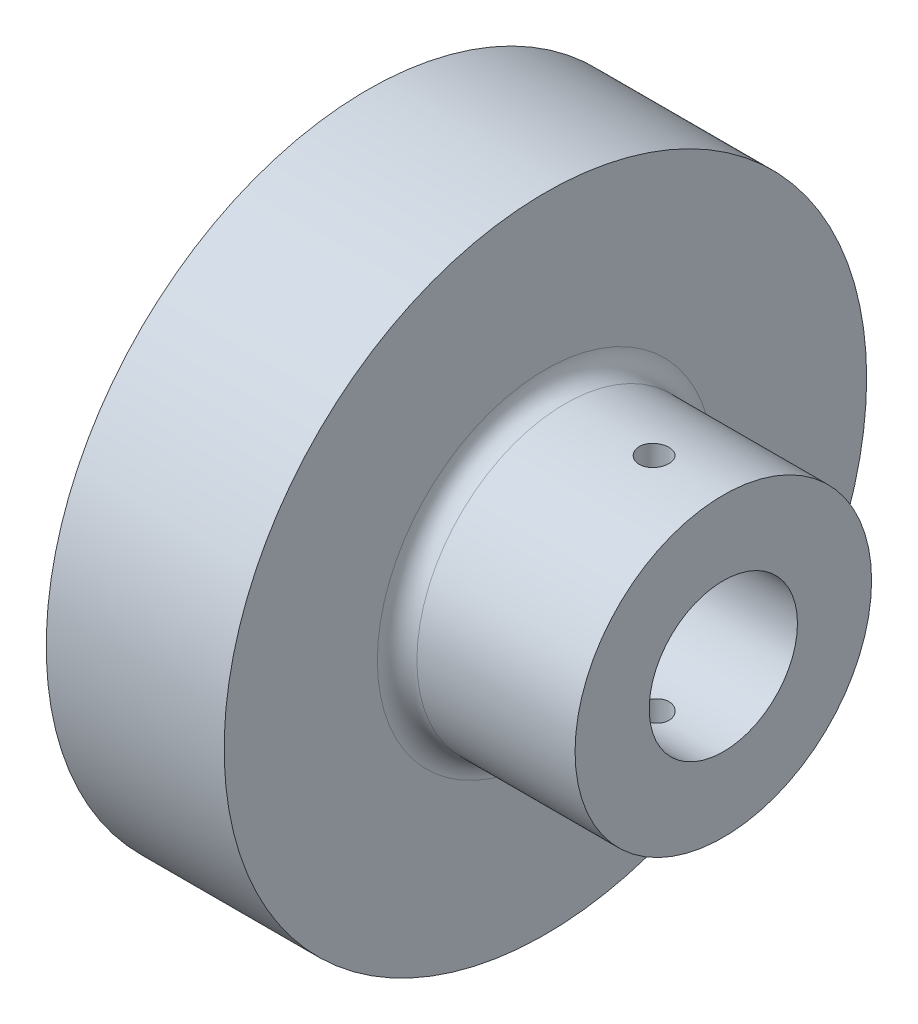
ISO-10303-21;
HEADER;
FILE_DESCRIPTION(('STEP AP214'),'2;1');
FILE_NAME('part.step','',(''),(''),'','','');
FILE_SCHEMA(('AUTOMOTIVE_DESIGN { 1 0 10303 214 1 1 1 1 }'));
ENDSEC;
DATA;
#1=APPLICATION_CONTEXT('core data for automotive mechanical design processes');
#2=APPLICATION_PROTOCOL_DEFINITION('international standard','automotive_design',2000,#1);
#3=PRODUCT_CONTEXT('',#1,'mechanical');
#4=PRODUCT('Part','Part','',(#3));
#5=PRODUCT_RELATED_PRODUCT_CATEGORY('part','',(#4));
#6=PRODUCT_DEFINITION_FORMATION('','',#4);
#7=PRODUCT_DEFINITION_CONTEXT('part definition',#1,'design');
#8=PRODUCT_DEFINITION('design','',#6,#7);
#9=PRODUCT_DEFINITION_SHAPE('','',#8);
#10=(LENGTH_UNIT() NAMED_UNIT(*) SI_UNIT(.MILLI.,.METRE.));
#11=(NAMED_UNIT(*) PLANE_ANGLE_UNIT() SI_UNIT($,.RADIAN.));
#12=(NAMED_UNIT(*) SI_UNIT($,.STERADIAN.) SOLID_ANGLE_UNIT());
#13=UNCERTAINTY_MEASURE_WITH_UNIT(LENGTH_MEASURE(1.E-05),#10,'distance_accuracy_value','');
#14=(GEOMETRIC_REPRESENTATION_CONTEXT(3) GLOBAL_UNCERTAINTY_ASSIGNED_CONTEXT((#13)) GLOBAL_UNIT_ASSIGNED_CONTEXT((#10,
#11,#12)) REPRESENTATION_CONTEXT('',''));
#15=CARTESIAN_POINT('',(0.,0.,0.));
#16=DIRECTION('',(0.,0.,1.));
#17=DIRECTION('',(1.,0.,0.));
#18=AXIS2_PLACEMENT_3D('',#15,#16,#17);
#19=CARTESIAN_POINT('',(74.9237880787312,0.,0.));
#20=DIRECTION('',(1.,0.,0.));
#21=DIRECTION('',(0.,0.,-1.));
#22=AXIS2_PLACEMENT_3D('',#19,#20,#21);
#23=CYLINDRICAL_SURFACE('',#22,7.49999999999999);
#24=CARTESIAN_POINT('',(31.3659501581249,-7.34846922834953,-1.5));
#25=CARTESIAN_POINT('',(31.4492967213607,-7.34847088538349,-1.49999691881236));
#26=CARTESIAN_POINT('',(31.5326820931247,-7.34990262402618,-1.49302975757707));
#27=CARTESIAN_POINT('',(31.6970939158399,-7.35546646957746,-1.46536842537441));
#28=CARTESIAN_POINT('',(31.778118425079,-7.35960073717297,-1.44466327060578));
#29=CARTESIAN_POINT('',(31.9354061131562,-7.37008310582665,-1.39019367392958));
#30=CARTESIAN_POINT('',(32.0116739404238,-7.37642900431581,-1.35644222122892));
#31=CARTESIAN_POINT('',(32.1574624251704,-7.39061699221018,-1.27687366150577));
#32=CARTESIAN_POINT('',(32.2269834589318,-7.39845899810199,-1.23105722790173));
#33=CARTESIAN_POINT('',(32.3582916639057,-7.4148794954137,-1.12796861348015));
#34=CARTESIAN_POINT('',(32.4199695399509,-7.42346606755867,-1.07055848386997));
#35=CARTESIAN_POINT('',(32.5328864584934,-7.44033708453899,-0.946210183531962));
#36=CARTESIAN_POINT('',(32.5841247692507,-7.44862150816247,-0.879271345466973));
#37=CARTESIAN_POINT('',(32.6751321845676,-7.46404194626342,-0.73704203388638));
#38=CARTESIAN_POINT('',(32.7147974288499,-7.47116732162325,-0.661683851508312));
#39=CARTESIAN_POINT('',(32.7808625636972,-7.48337605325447,-0.505206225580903));
#40=CARTESIAN_POINT('',(32.8072636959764,-7.48845960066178,-0.424087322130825));
#41=CARTESIAN_POINT('',(32.8457109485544,-7.49595481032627,-0.259525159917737));
#42=CARTESIAN_POINT('',(32.8579416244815,-7.4984007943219,-0.176126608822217));
#43=CARTESIAN_POINT('',(32.8682765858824,-7.50046381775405,-0.00842785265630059));
#44=CARTESIAN_POINT('',(32.8663822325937,-7.50008112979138,0.0758722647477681));
#45=CARTESIAN_POINT('',(32.8486608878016,-7.49655652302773,0.241713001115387));
#46=CARTESIAN_POINT('',(32.8330326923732,-7.49345397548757,0.323275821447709));
#47=CARTESIAN_POINT('',(32.7886026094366,-7.48488265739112,0.482597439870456));
#48=CARTESIAN_POINT('',(32.7598001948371,-7.47941379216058,0.560356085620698));
#49=CARTESIAN_POINT('',(32.689655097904,-7.46665944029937,0.710429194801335));
#50=CARTESIAN_POINT('',(32.6482345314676,-7.45936272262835,0.782706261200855));
#51=CARTESIAN_POINT('',(32.55408654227,-7.44375704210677,0.91935756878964));
#52=CARTESIAN_POINT('',(32.5013578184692,-7.43544796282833,0.983730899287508));
#53=CARTESIAN_POINT('',(32.3849997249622,-7.41856446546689,1.10392714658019));
#54=CARTESIAN_POINT('',(32.3211963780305,-7.40998794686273,1.15958147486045));
#55=CARTESIAN_POINT('',(32.1850754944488,-7.3936735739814,1.25942773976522));
#56=CARTESIAN_POINT('',(32.1127577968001,-7.38593573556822,1.30361945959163));
#57=CARTESIAN_POINT('',(31.9614189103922,-7.37217071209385,1.37934422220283));
#58=CARTESIAN_POINT('',(31.8823837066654,-7.36614722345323,1.41084997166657));
#59=CARTESIAN_POINT('',(31.7199931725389,-7.35654714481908,1.46008551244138));
#60=CARTESIAN_POINT('',(31.6366384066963,-7.35297023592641,1.47781709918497));
#61=CARTESIAN_POINT('',(31.4695028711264,-7.34873218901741,1.49874900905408));
#62=CARTESIAN_POINT('',(31.3857537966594,-7.34802220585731,1.50219278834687));
#63=CARTESIAN_POINT('',(31.2188778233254,-7.3494672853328,1.49510644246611));
#64=CARTESIAN_POINT('',(31.1357508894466,-7.35162218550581,1.48457710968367));
#65=CARTESIAN_POINT('',(30.9732971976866,-7.35850848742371,1.45005331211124));
#66=CARTESIAN_POINT('',(30.8939416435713,-7.36321498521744,1.42618893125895));
#67=CARTESIAN_POINT('',(30.7403552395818,-7.37465234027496,1.36581155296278));
#68=CARTESIAN_POINT('',(30.6661248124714,-7.38138336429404,1.32929751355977));
#69=CARTESIAN_POINT('',(30.5238304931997,-7.39622108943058,1.2441062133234));
#70=CARTESIAN_POINT('',(30.4558595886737,-7.40434457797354,1.19527661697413));
#71=CARTESIAN_POINT('',(30.3289876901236,-7.42100585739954,1.08704335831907));
#72=CARTESIAN_POINT('',(30.270087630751,-7.42954369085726,1.0276386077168));
#73=CARTESIAN_POINT('',(30.1621063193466,-7.44623018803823,0.898848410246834));
#74=CARTESIAN_POINT('',(30.1131896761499,-7.45437086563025,0.829323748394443));
#75=CARTESIAN_POINT('',(30.0277313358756,-7.46920691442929,0.68290184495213));
#76=CARTESIAN_POINT('',(29.9911891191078,-7.47590234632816,0.606004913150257));
#77=CARTESIAN_POINT('',(29.931756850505,-7.487059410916,0.447454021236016));
#78=CARTESIAN_POINT('',(29.9087893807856,-7.49153368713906,0.365830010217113));
#79=CARTESIAN_POINT('',(29.8769132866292,-7.4977985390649,0.199784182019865));
#80=CARTESIAN_POINT('',(29.8680029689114,-7.49958943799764,0.115362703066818));
#81=CARTESIAN_POINT('',(29.8645596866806,-7.5002781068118,-0.0523093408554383));
#82=CARTESIAN_POINT('',(29.8697792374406,-7.49922567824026,-0.135554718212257));
#83=CARTESIAN_POINT('',(29.8939010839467,-7.49445065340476,-0.299956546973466));
#84=CARTESIAN_POINT('',(29.912803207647,-7.49072809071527,-0.381113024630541));
#85=CARTESIAN_POINT('',(29.9636436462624,-7.48103247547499,-0.538879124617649));
#86=CARTESIAN_POINT('',(29.9955522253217,-7.47506455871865,-0.615498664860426));
#87=CARTESIAN_POINT('',(30.0714685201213,-7.46152083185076,-0.762331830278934));
#88=CARTESIAN_POINT('',(30.1154771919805,-7.45394489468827,-0.832544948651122));
#89=CARTESIAN_POINT('',(30.2151792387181,-7.4378639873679,-0.96579583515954));
#90=CARTESIAN_POINT('',(30.2710496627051,-7.42934600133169,-1.02869957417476));
#91=CARTESIAN_POINT('',(30.3925255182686,-7.41241834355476,-1.14432392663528));
#92=CARTESIAN_POINT('',(30.458133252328,-7.40400869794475,-1.19704212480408));
#93=CARTESIAN_POINT('',(30.5980691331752,-7.3881501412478,-1.29133832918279));
#94=CARTESIAN_POINT('',(30.6724835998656,-7.3807125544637,-1.33279022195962));
#95=CARTESIAN_POINT('',(30.8273493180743,-7.36777855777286,-1.40253607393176));
#96=CARTESIAN_POINT('',(30.9077950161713,-7.36228038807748,-1.43084196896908));
#97=CARTESIAN_POINT('',(31.0513438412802,-7.35494521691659,-1.46800370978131));
#98=CARTESIAN_POINT('',(31.1136282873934,-7.35253177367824,-1.47998084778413));
#99=CARTESIAN_POINT('',(31.2392510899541,-7.3492931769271,-1.49598002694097));
#100=CARTESIAN_POINT('',(31.3025894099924,-7.34846796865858,-1.50000234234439));
#101=CARTESIAN_POINT('',(31.3659501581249,-7.34846922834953,-1.5));
#102=B_SPLINE_CURVE_WITH_KNOTS('',3,(#24,#25,#26,#27,#28,#29,#30,#31,#32,#33,#34,#35,#36,#37,
#38,#39,#40,#41,#42,#43,#44,#45,#46,#47,#48,#49,#50,#51,#52,#53,#54,#55,#56,#57,#58,#59,#60,#61,
#62,#63,#64,#65,#66,#67,#68,#69,#70,#71,#72,#73,#74,#75,#76,#77,#78,#79,#80,#81,#82,#83,#84,#85,
#86,#87,#88,#89,#90,#91,#92,#93,#94,#95,#96,#97,#98,#99,#100,#101),.UNSPECIFIED.,.T.,.F.,(4,2,2,
2,2,2,2,2,2,2,2,2,2,2,2,2,2,2,2,2,2,2,2,2,2,2,2,2,2,2,2,2,2,2,2,2,2,2,4),(0.,0.249807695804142,
0.499815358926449,0.749574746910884,0.999320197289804,1.25223378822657,1.50516510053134,
1.76030100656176,2.01541302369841,2.26716373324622,2.51889018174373,2.76703184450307,
3.01518343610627,3.26489886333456,3.514643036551,3.76874020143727,4.02284217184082,
4.27748794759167,4.53210052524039,4.78235636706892,5.03259801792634,5.2804401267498,
5.52830265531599,5.77939589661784,6.03051499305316,6.28548902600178,6.54045234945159,
6.79394720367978,7.04741152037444,7.29646526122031,7.54551587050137,7.7940002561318,
8.04250428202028,8.29501728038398,8.54759008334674,8.80288347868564,9.05794462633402,
9.24785705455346,9.43776293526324),.UNSPECIFIED.);
#103=CARTESIAN_POINT('',(31.3659501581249,-7.34846922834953,-1.5));
#104=VERTEX_POINT('',#103);
#105=EDGE_CURVE('E75',#104,#104,#102,.T.);
#106=ORIENTED_EDGE('',*,*,#105,.T.);
#107=EDGE_LOOP('',(#106));
#108=FACE_BOUND('',#107,.T.);
#109=CARTESIAN_POINT('',(38.3659501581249,0.,0.));
#110=DIRECTION('',(1.,0.,0.));
#111=DIRECTION('',(0.,0.,-1.));
#112=AXIS2_PLACEMENT_3D('',#109,#110,#111);
#113=CIRCLE('',#112,7.5);
#114=CARTESIAN_POINT('',(38.3659501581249,0.,-7.5));
#115=VERTEX_POINT('',#114);
#116=EDGE_CURVE('E65',#115,#115,#113,.T.);
#117=ORIENTED_EDGE('',*,*,#116,.T.);
#118=EDGE_LOOP('',(#117));
#119=FACE_BOUND('',#118,.T.);
#120=CARTESIAN_POINT('',(10.3659501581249,0.,0.));
#121=DIRECTION('',(1.,0.,0.));
#122=DIRECTION('',(0.,0.,-1.));
#123=AXIS2_PLACEMENT_3D('',#120,#121,#122);
#124=CIRCLE('',#123,7.49999999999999);
#125=CARTESIAN_POINT('',(10.3659501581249,0.,-7.49999999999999));
#126=VERTEX_POINT('',#125);
#127=EDGE_CURVE('E157',#126,#126,#124,.T.);
#128=ORIENTED_EDGE('',*,*,#127,.F.);
#129=EDGE_LOOP('',(#128));
#130=FACE_BOUND('',#129,.T.);
#131=CARTESIAN_POINT('',(31.3659501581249,7.34846922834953,-1.5));
#132=CARTESIAN_POINT('',(31.2826035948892,7.34847088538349,-1.49999691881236));
#133=CARTESIAN_POINT('',(31.1992182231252,7.34990262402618,-1.49302975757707));
#134=CARTESIAN_POINT('',(31.03480640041,7.35546646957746,-1.46536842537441));
#135=CARTESIAN_POINT('',(30.9537818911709,7.35960073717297,-1.44466327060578));
#136=CARTESIAN_POINT('',(30.7964942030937,7.37008310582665,-1.39019367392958));
#137=CARTESIAN_POINT('',(30.7202263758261,7.37642900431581,-1.35644222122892));
#138=CARTESIAN_POINT('',(30.5744378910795,7.39061699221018,-1.27687366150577));
#139=CARTESIAN_POINT('',(30.5049168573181,7.39845899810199,-1.23105722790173));
#140=CARTESIAN_POINT('',(30.3736086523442,7.4148794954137,-1.12796861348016));
#141=CARTESIAN_POINT('',(30.311930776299,7.42346606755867,-1.07055848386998));
#142=CARTESIAN_POINT('',(30.1990138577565,7.44033708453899,-0.946210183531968));
#143=CARTESIAN_POINT('',(30.1477755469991,7.44862150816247,-0.879271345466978));
#144=CARTESIAN_POINT('',(30.0567681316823,7.46404194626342,-0.737042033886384));
#145=CARTESIAN_POINT('',(30.0171028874,7.47116732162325,-0.661683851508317));
#146=CARTESIAN_POINT('',(29.9510377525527,7.48337605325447,-0.505206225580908));
#147=CARTESIAN_POINT('',(29.9246366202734,7.48845960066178,-0.42408732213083));
#148=CARTESIAN_POINT('',(29.8861893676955,7.49595481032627,-0.259525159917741));
#149=CARTESIAN_POINT('',(29.8739586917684,7.4984007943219,-0.176126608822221));
#150=CARTESIAN_POINT('',(29.8636237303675,7.50046381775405,-0.00842785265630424));
#151=CARTESIAN_POINT('',(29.8655180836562,7.50008112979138,0.0758722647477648));
#152=CARTESIAN_POINT('',(29.8832394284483,7.49655652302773,0.241713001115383));
#153=CARTESIAN_POINT('',(29.8988676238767,7.49345397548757,0.323275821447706));
#154=CARTESIAN_POINT('',(29.9432977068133,7.48488265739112,0.482597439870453));
#155=CARTESIAN_POINT('',(29.9721001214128,7.47941379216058,0.560356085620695));
#156=CARTESIAN_POINT('',(30.0422452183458,7.46665944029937,0.710429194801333));
#157=CARTESIAN_POINT('',(30.0836657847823,7.45936272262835,0.782706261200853));
#158=CARTESIAN_POINT('',(30.1778137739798,7.44375704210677,0.919357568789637));
#159=CARTESIAN_POINT('',(30.2305424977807,7.43544796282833,0.983730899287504));
#160=CARTESIAN_POINT('',(30.3469005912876,7.41856446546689,1.10392714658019));
#161=CARTESIAN_POINT('',(30.4107039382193,7.40998794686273,1.15958147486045));
#162=CARTESIAN_POINT('',(30.5468248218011,7.3936735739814,1.25942773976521));
#163=CARTESIAN_POINT('',(30.6191425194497,7.38593573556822,1.30361945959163));
#164=CARTESIAN_POINT('',(30.7704814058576,7.37217071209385,1.37934422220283));
#165=CARTESIAN_POINT('',(30.8495166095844,7.36614722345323,1.41084997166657));
#166=CARTESIAN_POINT('',(31.0119071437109,7.35654714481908,1.46008551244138));
#167=CARTESIAN_POINT('',(31.0952619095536,7.35297023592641,1.47781709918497));
#168=CARTESIAN_POINT('',(31.2623974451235,7.34873218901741,1.49874900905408));
#169=CARTESIAN_POINT('',(31.3461465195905,7.34802220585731,1.50219278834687));
#170=CARTESIAN_POINT('',(31.5130224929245,7.3494672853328,1.49510644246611));
#171=CARTESIAN_POINT('',(31.5961494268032,7.35162218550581,1.48457710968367));
#172=CARTESIAN_POINT('',(31.7586031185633,7.35850848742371,1.45005331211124));
#173=CARTESIAN_POINT('',(31.8379586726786,7.36321498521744,1.42618893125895));
#174=CARTESIAN_POINT('',(31.9915450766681,7.37465234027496,1.36581155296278));
#175=CARTESIAN_POINT('',(32.0657755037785,7.38138336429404,1.32929751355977));
#176=CARTESIAN_POINT('',(32.2080698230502,7.39622108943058,1.2441062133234));
#177=CARTESIAN_POINT('',(32.2760407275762,7.40434457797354,1.19527661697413));
#178=CARTESIAN_POINT('',(32.4029126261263,7.42100585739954,1.08704335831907));
#179=CARTESIAN_POINT('',(32.4618126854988,7.42954369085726,1.02763860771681));
#180=CARTESIAN_POINT('',(32.5697939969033,7.44623018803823,0.898848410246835));
#181=CARTESIAN_POINT('',(32.6187106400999,7.45437086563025,0.829323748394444));
#182=CARTESIAN_POINT('',(32.7041689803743,7.46920691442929,0.682901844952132));
#183=CARTESIAN_POINT('',(32.7407111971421,7.47590234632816,0.60600491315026));
#184=CARTESIAN_POINT('',(32.8001434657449,7.487059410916,0.447454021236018));
#185=CARTESIAN_POINT('',(32.8231109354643,7.49153368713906,0.365830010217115));
#186=CARTESIAN_POINT('',(32.8549870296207,7.4977985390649,0.199784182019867));
#187=CARTESIAN_POINT('',(32.8638973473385,7.49958943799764,0.115362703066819));
#188=CARTESIAN_POINT('',(32.8673406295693,7.5002781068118,-0.052309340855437));
#189=CARTESIAN_POINT('',(32.8621210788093,7.49922567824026,-0.135554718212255));
#190=CARTESIAN_POINT('',(32.8379992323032,7.49445065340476,-0.299956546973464));
#191=CARTESIAN_POINT('',(32.8190971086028,7.49072809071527,-0.381113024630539));
#192=CARTESIAN_POINT('',(32.7682566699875,7.48103247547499,-0.538879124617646));
#193=CARTESIAN_POINT('',(32.7363480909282,7.47506455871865,-0.615498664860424));
#194=CARTESIAN_POINT('',(32.6604317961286,7.46152083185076,-0.762331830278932));
#195=CARTESIAN_POINT('',(32.6164231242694,7.45394489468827,-0.83254494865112));
#196=CARTESIAN_POINT('',(32.5167210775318,7.4378639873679,-0.965795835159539));
#197=CARTESIAN_POINT('',(32.4608506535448,7.42934600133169,-1.02869957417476));
#198=CARTESIAN_POINT('',(32.3393747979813,7.41241834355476,-1.14432392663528));
#199=CARTESIAN_POINT('',(32.2737670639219,7.40400869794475,-1.19704212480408));
#200=CARTESIAN_POINT('',(32.1338311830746,7.3881501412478,-1.29133832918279));
#201=CARTESIAN_POINT('',(32.0594167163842,7.38071255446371,-1.33279022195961));
#202=CARTESIAN_POINT('',(31.9045509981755,7.36777855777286,-1.40253607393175));
#203=CARTESIAN_POINT('',(31.8241053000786,7.36228038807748,-1.43084196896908));
#204=CARTESIAN_POINT('',(31.6805564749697,7.35494521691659,-1.46800370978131));
#205=CARTESIAN_POINT('',(31.6182720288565,7.35253177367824,-1.47998084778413));
#206=CARTESIAN_POINT('',(31.4926492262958,7.3492931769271,-1.49598002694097));
#207=CARTESIAN_POINT('',(31.4293109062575,7.34846796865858,-1.50000234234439));
#208=CARTESIAN_POINT('',(31.3659501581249,7.34846922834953,-1.5));
#209=B_SPLINE_CURVE_WITH_KNOTS('',3,(#131,#132,#133,#134,#135,#136,#137,#138,#139,#140,#141,
#142,#143,#144,#145,#146,#147,#148,#149,#150,#151,#152,#153,#154,#155,#156,#157,#158,#159,#160,
#161,#162,#163,#164,#165,#166,#167,#168,#169,#170,#171,#172,#173,#174,#175,#176,#177,#178,#179,
#180,#181,#182,#183,#184,#185,#186,#187,#188,#189,#190,#191,#192,#193,#194,#195,#196,#197,#198,
#199,#200,#201,#202,#203,#204,#205,#206,#207,#208),.UNSPECIFIED.,.T.,.F.,(4,2,2,2,2,2,2,2,2,2,2,
2,2,2,2,2,2,2,2,2,2,2,2,2,2,2,2,2,2,2,2,2,2,2,2,2,2,2,4),(0.,0.249807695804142,
0.499815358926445,0.749574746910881,0.999320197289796,1.25223378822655,1.50516510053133,
1.76030100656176,2.0154130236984,2.26716373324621,2.51889018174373,2.76703184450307,
3.01518343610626,3.26489886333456,3.514643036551,3.76874020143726,4.02284217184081,
4.27748794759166,4.53210052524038,4.78235636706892,5.03259801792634,5.28044012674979,
5.52830265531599,5.77939589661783,6.03051499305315,6.28548902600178,6.54045234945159,
6.79394720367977,7.04741152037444,7.29646526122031,7.54551587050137,7.7940002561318,
8.04250428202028,8.29501728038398,8.54759008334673,8.80288347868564,9.05794462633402,
9.24785705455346,9.43776293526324),.UNSPECIFIED.);
#210=CARTESIAN_POINT('',(31.3659501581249,7.34846922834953,-1.5));
#211=VERTEX_POINT('',#210);
#212=EDGE_CURVE('E101',#211,#211,#209,.T.);
#213=ORIENTED_EDGE('',*,*,#212,.T.);
#214=EDGE_LOOP('',(#213));
#215=FACE_BOUND('',#214,.T.);
#216=ADVANCED_FACE('F41',(#108,#119,#130,#215),#23,.F.);
#217=CARTESIAN_POINT('',(74.9237880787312,0.,0.));
#218=DIRECTION('',(1.,0.,0.));
#219=DIRECTION('',(0.,0.,-1.));
#220=AXIS2_PLACEMENT_3D('',#217,#218,#219);
#221=CYLINDRICAL_SURFACE('',#220,15.);
#222=CARTESIAN_POINT('',(22.3659501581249,0.,0.));
#223=DIRECTION('',(1.,0.,0.));
#224=DIRECTION('',(0.,0.,-1.));
#225=AXIS2_PLACEMENT_3D('',#222,#223,#224);
#226=CIRCLE('',#225,15.);
#227=CARTESIAN_POINT('',(22.3659501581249,0.,-15.));
#228=VERTEX_POINT('',#227);
#229=EDGE_CURVE('E59',#228,#228,#226,.T.);
#230=ORIENTED_EDGE('',*,*,#229,.T.);
#231=EDGE_LOOP('',(#230));
#232=FACE_BOUND('',#231,.T.);
#233=CARTESIAN_POINT('',(31.3659501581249,-14.9248115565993,-1.5));
#234=CARTESIAN_POINT('',(31.2819208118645,-14.9248125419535,-1.49999636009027));
#235=CARTESIAN_POINT('',(31.1978359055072,-14.9255288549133,-1.49291528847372));
#236=CARTESIAN_POINT('',(31.0319973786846,-14.9283163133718,-1.46477447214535));
#237=CARTESIAN_POINT('',(30.9502464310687,-14.9303889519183,-1.44369932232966));
#238=CARTESIAN_POINT('',(30.7915014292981,-14.9356519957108,-1.38819017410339));
#239=CARTESIAN_POINT('',(30.7145045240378,-14.9388417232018,-1.35376427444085));
#240=CARTESIAN_POINT('',(30.5673984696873,-14.9459787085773,-1.27254640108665));
#241=CARTESIAN_POINT('',(30.4972879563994,-14.9499258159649,-1.22575688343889));
#242=CARTESIAN_POINT('',(30.3656732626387,-14.9581489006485,-1.12095714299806));
#243=CARTESIAN_POINT('',(30.3041976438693,-14.962425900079,-1.06291112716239));
#244=CARTESIAN_POINT('',(30.1918437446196,-14.9708175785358,-0.937322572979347));
#245=CARTESIAN_POINT('',(30.1409659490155,-14.9749322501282,-0.869779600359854));
#246=CARTESIAN_POINT('',(30.0511532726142,-14.9825457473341,-0.726939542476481));
#247=CARTESIAN_POINT('',(30.0122436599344,-14.9860432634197,-0.651626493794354));
#248=CARTESIAN_POINT('',(29.9476335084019,-14.9920172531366,-0.495494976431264));
#249=CARTESIAN_POINT('',(29.9219326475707,-14.9944937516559,-0.414676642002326));
#250=CARTESIAN_POINT('',(29.8845532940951,-14.9981394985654,-0.250117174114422));
#251=CARTESIAN_POINT('',(29.872827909,-14.9993131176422,-0.16638679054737));
#252=CARTESIAN_POINT('',(29.8635872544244,-15.0002357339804,0.00186111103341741));
#253=CARTESIAN_POINT('',(29.8660716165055,-14.9999847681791,0.0863786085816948));
#254=CARTESIAN_POINT('',(29.8851418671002,-14.9980900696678,0.253483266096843));
#255=CARTESIAN_POINT('',(29.9016773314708,-14.9964513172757,0.336076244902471));
#256=CARTESIAN_POINT('',(29.9483018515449,-14.9919709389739,0.497308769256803));
#257=CARTESIAN_POINT('',(29.9783910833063,-14.9891292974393,0.575948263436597));
#258=CARTESIAN_POINT('',(30.0513243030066,-14.9825540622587,0.727200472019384));
#259=CARTESIAN_POINT('',(30.0941906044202,-14.9788189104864,0.799802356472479));
#260=CARTESIAN_POINT('',(30.1914449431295,-14.9708757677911,0.936800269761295));
#261=CARTESIAN_POINT('',(30.2458333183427,-14.9666677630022,1.00119605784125));
#262=CARTESIAN_POINT('',(30.3648715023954,-14.9582294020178,1.12024915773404));
#263=CARTESIAN_POINT('',(30.4295651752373,-14.9539990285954,1.17486261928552));
#264=CARTESIAN_POINT('',(30.5672254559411,-14.9460110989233,1.27246130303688));
#265=CARTESIAN_POINT('',(30.6401920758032,-14.9422535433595,1.31544650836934));
#266=CARTESIAN_POINT('',(30.7923606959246,-14.9356363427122,1.38856827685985));
#267=CARTESIAN_POINT('',(30.8715640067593,-14.9327768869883,1.41870213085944));
#268=CARTESIAN_POINT('',(31.033941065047,-14.9282835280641,1.46523110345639));
#269=CARTESIAN_POINT('',(31.1171146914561,-14.9266495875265,1.48162664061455));
#270=CARTESIAN_POINT('',(31.2846864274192,-14.9247987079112,1.50015716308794));
#271=CARTESIAN_POINT('',(31.3690776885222,-14.924575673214,1.50235349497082));
#272=CARTESIAN_POINT('',(31.5370270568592,-14.9255557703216,1.49258437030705));
#273=CARTESIAN_POINT('',(31.6205851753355,-14.9267588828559,1.48061910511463));
#274=CARTESIAN_POINT('',(31.7843175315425,-14.930450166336,1.44291776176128));
#275=CARTESIAN_POINT('',(31.8644985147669,-14.9329356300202,1.41721069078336));
#276=CARTESIAN_POINT('',(32.0194102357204,-14.9389093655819,1.35278507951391));
#277=CARTESIAN_POINT('',(32.0941408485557,-14.94239766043,1.31406624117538));
#278=CARTESIAN_POINT('',(32.2363101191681,-14.9499987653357,1.22456250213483));
#279=CARTESIAN_POINT('',(32.3037230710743,-14.9541136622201,1.17373694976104));
#280=CARTESIAN_POINT('',(32.429082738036,-14.9624974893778,1.06152080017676));
#281=CARTESIAN_POINT('',(32.4870292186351,-14.966766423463,1.0001299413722));
#282=CARTESIAN_POINT('',(32.5920226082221,-14.9749957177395,0.86825970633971));
#283=CARTESIAN_POINT('',(32.6390294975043,-14.9789549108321,0.797748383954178));
#284=CARTESIAN_POINT('',(32.7205339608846,-14.9861016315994,0.649796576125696));
#285=CARTESIAN_POINT('',(32.7550317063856,-14.9892891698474,0.572356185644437));
#286=CARTESIAN_POINT('',(32.8104708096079,-14.9945281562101,0.41288418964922));
#287=CARTESIAN_POINT('',(32.8314363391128,-14.9965816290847,0.330861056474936));
#288=CARTESIAN_POINT('',(32.8592947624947,-14.9993294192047,0.164437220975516));
#289=CARTESIAN_POINT('',(32.866188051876,-15.0000237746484,0.0800365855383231));
#290=CARTESIAN_POINT('',(32.865700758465,-14.999975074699,-0.0883533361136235));
#291=CARTESIAN_POINT('',(32.85838230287,-14.99923827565,-0.172342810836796));
#292=CARTESIAN_POINT('',(32.8298095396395,-14.9964224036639,-0.337892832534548));
#293=CARTESIAN_POINT('',(32.8085552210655,-14.9943433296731,-0.419453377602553));
#294=CARTESIAN_POINT('',(32.7527312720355,-14.9890758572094,-0.57782986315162));
#295=CARTESIAN_POINT('',(32.7181634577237,-14.9858876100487,-0.654646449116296));
#296=CARTESIAN_POINT('',(32.6367004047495,-14.9787571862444,-0.801396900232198));
#297=CARTESIAN_POINT('',(32.5898052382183,-14.9748150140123,-0.871330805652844));
#298=CARTESIAN_POINT('',(32.4847857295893,-14.9665977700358,-1.00264908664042));
#299=CARTESIAN_POINT('',(32.4266151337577,-14.9623213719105,-1.06399638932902));
#300=CARTESIAN_POINT('',(32.3007871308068,-14.9539288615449,-1.17608663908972));
#301=CARTESIAN_POINT('',(32.2331274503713,-14.9498127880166,-1.22682703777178));
#302=CARTESIAN_POINT('',(32.0900536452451,-14.942195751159,-1.31636496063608));
#303=CARTESIAN_POINT('',(32.0146202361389,-14.9386963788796,-1.35513178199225));
#304=CARTESIAN_POINT('',(31.8583277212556,-14.9327279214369,-1.41939706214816));
#305=CARTESIAN_POINT('',(31.7774748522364,-14.9302576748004,-1.44491048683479));
#306=CARTESIAN_POINT('',(31.6411285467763,-14.9272501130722,-1.4755825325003));
#307=CARTESIAN_POINT('',(31.5865067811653,-14.9263399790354,-1.48472656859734));
#308=CARTESIAN_POINT('',(31.4765814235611,-14.9251203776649,-1.49693648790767));
#309=CARTESIAN_POINT('',(31.421277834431,-14.9248109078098,-1.5000023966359));
#310=CARTESIAN_POINT('',(31.3659501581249,-14.9248115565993,-1.5));
#311=B_SPLINE_CURVE_WITH_KNOTS('',3,(#233,#234,#235,#236,#237,#238,#239,#240,#241,#242,#243,
#244,#245,#246,#247,#248,#249,#250,#251,#252,#253,#254,#255,#256,#257,#258,#259,#260,#261,#262,
#263,#264,#265,#266,#267,#268,#269,#270,#271,#272,#273,#274,#275,#276,#277,#278,#279,#280,#281,
#282,#283,#284,#285,#286,#287,#288,#289,#290,#291,#292,#293,#294,#295,#296,#297,#298,#299,#300,
#301,#302,#303,#304,#305,#306,#307,#308,#309,#310),.UNSPECIFIED.,.T.,.F.,(4,2,2,2,2,2,2,2,2,2,2,
2,2,2,2,2,2,2,2,2,2,2,2,2,2,2,2,2,2,2,2,2,2,2,2,2,2,2,4),(0.,0.251885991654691,
0.504049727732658,0.756060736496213,1.00802172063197,1.26079742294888,1.5135846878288,
1.76690204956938,2.02021323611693,2.27267206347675,2.52512434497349,2.77667447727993,
3.02822787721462,3.28022318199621,3.53222587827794,3.78533137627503,4.03843724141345,
4.29159643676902,4.54474791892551,4.7968049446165,5.04885856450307,5.30038222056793,
5.55191163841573,5.80429784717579,6.05669030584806,6.30999205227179,6.56329032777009,
6.81613489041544,7.06897234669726,7.32070700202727,7.57244185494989,7.82414237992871,
8.075841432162,8.32859572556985,8.5814106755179,8.83486861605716,9.08803972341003,
9.25389041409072,9.41974040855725),.UNSPECIFIED.);
#312=CARTESIAN_POINT('',(31.3659501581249,-14.9248115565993,-1.5));
#313=VERTEX_POINT('',#312);
#314=EDGE_CURVE('E76',#313,#313,#311,.T.);
#315=ORIENTED_EDGE('',*,*,#314,.T.);
#316=EDGE_LOOP('',(#315));
#317=FACE_BOUND('',#316,.T.);
#318=CARTESIAN_POINT('',(38.3659501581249,0.,0.));
#319=DIRECTION('',(1.,0.,0.));
#320=DIRECTION('',(0.,0.,-1.));
#321=AXIS2_PLACEMENT_3D('',#318,#319,#320);
#322=CIRCLE('',#321,15.);
#323=CARTESIAN_POINT('',(38.3659501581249,0.,-15.));
#324=VERTEX_POINT('',#323);
#325=EDGE_CURVE('E138',#324,#324,#322,.T.);
#326=ORIENTED_EDGE('',*,*,#325,.F.);
#327=EDGE_LOOP('',(#326));
#328=FACE_BOUND('',#327,.T.);
#329=CARTESIAN_POINT('',(31.3659501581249,14.9248115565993,-1.5));
#330=CARTESIAN_POINT('',(31.4499795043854,14.9248125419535,-1.49999636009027));
#331=CARTESIAN_POINT('',(31.5340644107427,14.9255288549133,-1.49291528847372));
#332=CARTESIAN_POINT('',(31.6999029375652,14.9283163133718,-1.46477447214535));
#333=CARTESIAN_POINT('',(31.7816538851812,14.9303889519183,-1.44369932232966));
#334=CARTESIAN_POINT('',(31.9403988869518,14.9356519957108,-1.38819017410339));
#335=CARTESIAN_POINT('',(32.0173957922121,14.9388417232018,-1.35376427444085));
#336=CARTESIAN_POINT('',(32.1645018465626,14.9459787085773,-1.27254640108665));
#337=CARTESIAN_POINT('',(32.2346123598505,14.9499258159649,-1.22575688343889));
#338=CARTESIAN_POINT('',(32.3662270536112,14.9581489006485,-1.12095714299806));
#339=CARTESIAN_POINT('',(32.4277026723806,14.962425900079,-1.06291112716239));
#340=CARTESIAN_POINT('',(32.5400565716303,14.9708175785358,-0.937322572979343));
#341=CARTESIAN_POINT('',(32.5909343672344,14.9749322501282,-0.86977960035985));
#342=CARTESIAN_POINT('',(32.6807470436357,14.9825457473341,-0.726939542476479));
#343=CARTESIAN_POINT('',(32.7196566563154,14.9860432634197,-0.651626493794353));
#344=CARTESIAN_POINT('',(32.784266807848,14.9920172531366,-0.495494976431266));
#345=CARTESIAN_POINT('',(32.8099676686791,14.9944937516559,-0.414676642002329));
#346=CARTESIAN_POINT('',(32.8473470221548,14.9981394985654,-0.250117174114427));
#347=CARTESIAN_POINT('',(32.8590724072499,14.9993131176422,-0.166386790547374));
#348=CARTESIAN_POINT('',(32.8683130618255,15.0002357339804,0.00186111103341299));
#349=CARTESIAN_POINT('',(32.8658286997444,14.9999847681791,0.0863786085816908));
#350=CARTESIAN_POINT('',(32.8467584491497,14.9980900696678,0.253483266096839));
#351=CARTESIAN_POINT('',(32.8302229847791,14.9964513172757,0.336076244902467));
#352=CARTESIAN_POINT('',(32.783598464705,14.9919709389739,0.497308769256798));
#353=CARTESIAN_POINT('',(32.7535092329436,14.9891292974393,0.575948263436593));
#354=CARTESIAN_POINT('',(32.6805760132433,14.9825540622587,0.727200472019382));
#355=CARTESIAN_POINT('',(32.6377097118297,14.9788189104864,0.799802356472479));
#356=CARTESIAN_POINT('',(32.5404553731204,14.9708757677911,0.936800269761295));
#357=CARTESIAN_POINT('',(32.4860669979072,14.9666677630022,1.00119605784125));
#358=CARTESIAN_POINT('',(32.3670288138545,14.9582294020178,1.12024915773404));
#359=CARTESIAN_POINT('',(32.3023351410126,14.9539990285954,1.17486261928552));
#360=CARTESIAN_POINT('',(32.1646748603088,14.9460110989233,1.27246130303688));
#361=CARTESIAN_POINT('',(32.0917082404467,14.9422535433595,1.31544650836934));
#362=CARTESIAN_POINT('',(31.9395396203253,14.9356363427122,1.38856827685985));
#363=CARTESIAN_POINT('',(31.8603363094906,14.9327768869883,1.41870213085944));
#364=CARTESIAN_POINT('',(31.6979592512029,14.9282835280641,1.46523110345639));
#365=CARTESIAN_POINT('',(31.6147856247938,14.9266495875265,1.48162664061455));
#366=CARTESIAN_POINT('',(31.4472138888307,14.9247987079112,1.50015716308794));
#367=CARTESIAN_POINT('',(31.3628226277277,14.924575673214,1.50235349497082));
#368=CARTESIAN_POINT('',(31.1948732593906,14.9255557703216,1.49258437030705));
#369=CARTESIAN_POINT('',(31.1113151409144,14.9267588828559,1.48061910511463));
#370=CARTESIAN_POINT('',(30.9475827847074,14.930450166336,1.44291776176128));
#371=CARTESIAN_POINT('',(30.867401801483,14.9329356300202,1.41721069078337));
#372=CARTESIAN_POINT('',(30.7124900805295,14.9389093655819,1.35278507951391));
#373=CARTESIAN_POINT('',(30.6377594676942,14.94239766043,1.31406624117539));
#374=CARTESIAN_POINT('',(30.4955901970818,14.9499987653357,1.22456250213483));
#375=CARTESIAN_POINT('',(30.4281772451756,14.9541136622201,1.17373694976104));
#376=CARTESIAN_POINT('',(30.3028175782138,14.9624974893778,1.06152080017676));
#377=CARTESIAN_POINT('',(30.2448710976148,14.966766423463,1.0001299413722));
#378=CARTESIAN_POINT('',(30.1398777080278,14.9749957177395,0.868259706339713));
#379=CARTESIAN_POINT('',(30.0928708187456,14.9789549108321,0.797748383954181));
#380=CARTESIAN_POINT('',(30.0113663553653,14.9861016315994,0.6497965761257));
#381=CARTESIAN_POINT('',(29.9768686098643,14.9892891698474,0.572356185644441));
#382=CARTESIAN_POINT('',(29.9214295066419,14.9945281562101,0.412884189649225));
#383=CARTESIAN_POINT('',(29.9004639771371,14.9965816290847,0.330861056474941));
#384=CARTESIAN_POINT('',(29.8726055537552,14.9993294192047,0.16443722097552));
#385=CARTESIAN_POINT('',(29.8657122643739,15.0000237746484,0.0800365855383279));
#386=CARTESIAN_POINT('',(29.8661995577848,14.999975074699,-0.0883533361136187));
#387=CARTESIAN_POINT('',(29.8735180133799,14.99923827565,-0.172342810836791));
#388=CARTESIAN_POINT('',(29.9020907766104,14.9964224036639,-0.337892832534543));
#389=CARTESIAN_POINT('',(29.9233450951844,14.9943433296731,-0.419453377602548));
#390=CARTESIAN_POINT('',(29.9791690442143,14.9890758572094,-0.577829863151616));
#391=CARTESIAN_POINT('',(30.0137368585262,14.9858876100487,-0.654646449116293));
#392=CARTESIAN_POINT('',(30.0951999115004,14.9787571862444,-0.801396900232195));
#393=CARTESIAN_POINT('',(30.1420950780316,14.9748150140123,-0.871330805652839));
#394=CARTESIAN_POINT('',(30.2471145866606,14.9665977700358,-1.00264908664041));
#395=CARTESIAN_POINT('',(30.3052851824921,14.9623213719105,-1.06399638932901));
#396=CARTESIAN_POINT('',(30.4311131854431,14.9539288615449,-1.17608663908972));
#397=CARTESIAN_POINT('',(30.4987728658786,14.9498127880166,-1.22682703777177));
#398=CARTESIAN_POINT('',(30.6418466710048,14.942195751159,-1.31636496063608));
#399=CARTESIAN_POINT('',(30.717280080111,14.9386963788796,-1.35513178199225));
#400=CARTESIAN_POINT('',(30.8735725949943,14.9327279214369,-1.41939706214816));
#401=CARTESIAN_POINT('',(30.9544254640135,14.9302576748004,-1.44491048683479));
#402=CARTESIAN_POINT('',(31.0907717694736,14.9272501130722,-1.4755825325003));
#403=CARTESIAN_POINT('',(31.1453935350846,14.9263399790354,-1.48472656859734));
#404=CARTESIAN_POINT('',(31.2553188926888,14.9251203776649,-1.49693648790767));
#405=CARTESIAN_POINT('',(31.3106224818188,14.9248109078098,-1.5000023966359));
#406=CARTESIAN_POINT('',(31.3659501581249,14.9248115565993,-1.5));
#407=B_SPLINE_CURVE_WITH_KNOTS('',3,(#329,#330,#331,#332,#333,#334,#335,#336,#337,#338,#339,
#340,#341,#342,#343,#344,#345,#346,#347,#348,#349,#350,#351,#352,#353,#354,#355,#356,#357,#358,
#359,#360,#361,#362,#363,#364,#365,#366,#367,#368,#369,#370,#371,#372,#373,#374,#375,#376,#377,
#378,#379,#380,#381,#382,#383,#384,#385,#386,#387,#388,#389,#390,#391,#392,#393,#394,#395,#396,
#397,#398,#399,#400,#401,#402,#403,#404,#405,#406),.UNSPECIFIED.,.T.,.F.,(4,2,2,2,2,2,2,2,2,2,2,
2,2,2,2,2,2,2,2,2,2,2,2,2,2,2,2,2,2,2,2,2,2,2,2,2,2,2,4),(0.,0.251885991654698,
0.504049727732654,0.756060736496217,1.00802172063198,1.26079742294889,1.5135846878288,
1.76690204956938,2.02021323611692,2.27267206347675,2.52512434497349,2.77667447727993,
3.02822787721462,3.28022318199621,3.53222587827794,3.78533137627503,4.03843724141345,
4.29159643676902,4.54474791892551,4.7968049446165,5.04885856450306,5.30038222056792,
5.55191163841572,5.80429784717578,6.05669030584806,6.30999205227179,6.56329032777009,
6.81613489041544,7.06897234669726,7.32070700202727,7.57244185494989,7.82414237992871,
8.07584143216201,8.32859572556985,8.5814106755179,8.83486861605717,9.08803972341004,
9.25389041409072,9.41974040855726),.UNSPECIFIED.);
#408=CARTESIAN_POINT('',(31.3659501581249,14.9248115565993,-1.5));
#409=VERTEX_POINT('',#408);
#410=EDGE_CURVE('E66',#409,#409,#407,.T.);
#411=ORIENTED_EDGE('',*,*,#410,.T.);
#412=EDGE_LOOP('',(#411));
#413=FACE_BOUND('',#412,.T.);
#414=ADVANCED_FACE('F81',(#232,#317,#328,#413),#221,.T.);
#415=CARTESIAN_POINT('',(38.3659501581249,15.,0.));
#416=DIRECTION('',(1.,0.,0.));
#417=DIRECTION('',(0.,0.,-1.));
#418=AXIS2_PLACEMENT_3D('',#415,#416,#417);
#419=PLANE('',#418);
#420=ORIENTED_EDGE('',*,*,#325,.T.);
#421=EDGE_LOOP('',(#420));
#422=FACE_BOUND('',#421,.T.);
#423=ORIENTED_EDGE('',*,*,#116,.F.);
#424=EDGE_LOOP('',(#423));
#425=FACE_BOUND('',#424,.T.);
#426=ADVANCED_FACE('F113',(#422,#425),#419,.T.);
#427=CARTESIAN_POINT('',(10.3659501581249,7.49999999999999,0.));
#428=DIRECTION('',(-1.,0.,0.));
#429=DIRECTION('',(0.,0.,1.));
#430=AXIS2_PLACEMENT_3D('',#427,#428,#429);
#431=PLANE('',#430);
#432=CARTESIAN_POINT('',(10.3659501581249,0.,0.));
#433=DIRECTION('',(-1.,0.,0.));
#434=DIRECTION('',(0.,0.,1.));
#435=AXIS2_PLACEMENT_3D('',#432,#433,#434);
#436=CIRCLE('',#435,25.);
#437=CARTESIAN_POINT('',(10.3659501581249,0.,25.));
#438=VERTEX_POINT('',#437);
#439=EDGE_CURVE('E10',#438,#438,#436,.T.);
#440=ORIENTED_EDGE('',*,*,#439,.T.);
#441=EDGE_LOOP('',(#440));
#442=FACE_BOUND('',#441,.T.);
#443=ORIENTED_EDGE('',*,*,#127,.T.);
#444=EDGE_LOOP('',(#443));
#445=FACE_BOUND('',#444,.T.);
#446=ADVANCED_FACE('F111',(#442,#445),#431,.T.);
#447=CARTESIAN_POINT('',(74.9237880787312,0.,0.));
#448=DIRECTION('',(1.,0.,0.));
#449=DIRECTION('',(0.,0.,-1.));
#450=AXIS2_PLACEMENT_3D('',#447,#448,#449);
#451=CYLINDRICAL_SURFACE('',#450,27.);
#452=CARTESIAN_POINT('',(8.36595015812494,0.,0.));
#453=DIRECTION('',(-1.,0.,0.));
#454=DIRECTION('',(0.,0.,1.));
#455=AXIS2_PLACEMENT_3D('',#452,#453,#454);
#456=CIRCLE('',#455,27.);
#457=CARTESIAN_POINT('',(8.36595015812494,0.,27.));
#458=VERTEX_POINT('',#457);
#459=EDGE_CURVE('E49',#458,#458,#456,.F.);
#460=ORIENTED_EDGE('',*,*,#459,.T.);
#461=EDGE_LOOP('',(#460));
#462=FACE_BOUND('',#461,.T.);
#463=CARTESIAN_POINT('',(2.36595015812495,0.,0.));
#464=DIRECTION('',(1.,0.,0.));
#465=DIRECTION('',(0.,0.,-1.));
#466=AXIS2_PLACEMENT_3D('',#463,#464,#465);
#467=CIRCLE('',#466,27.);
#468=CARTESIAN_POINT('',(2.36595015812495,0.,-27.));
#469=VERTEX_POINT('',#468);
#470=EDGE_CURVE('E153',#469,#469,#467,.T.);
#471=ORIENTED_EDGE('',*,*,#470,.F.);
#472=EDGE_LOOP('',(#471));
#473=FACE_BOUND('',#472,.T.);
#474=ADVANCED_FACE('F171',(#462,#473),#451,.F.);
#475=CARTESIAN_POINT('',(2.36595015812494,27.,0.));
#476=DIRECTION('',(-1.,0.,0.));
#477=DIRECTION('',(0.,0.,1.));
#478=AXIS2_PLACEMENT_3D('',#475,#476,#477);
#479=PLANE('',#478);
#480=ORIENTED_EDGE('',*,*,#470,.T.);
#481=EDGE_LOOP('',(#480));
#482=FACE_BOUND('',#481,.T.);
#483=CARTESIAN_POINT('',(2.36595015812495,0.,0.));
#484=DIRECTION('',(1.,0.,0.));
#485=DIRECTION('',(0.,0.,-1.));
#486=AXIS2_PLACEMENT_3D('',#483,#484,#485);
#487=CIRCLE('',#486,32.5);
#488=CARTESIAN_POINT('',(2.36595015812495,0.,-32.5));
#489=VERTEX_POINT('',#488);
#490=EDGE_CURVE('E146',#489,#489,#487,.T.);
#491=ORIENTED_EDGE('',*,*,#490,.F.);
#492=EDGE_LOOP('',(#491));
#493=FACE_BOUND('',#492,.T.);
#494=ADVANCED_FACE('F175',(#482,#493),#479,.T.);
#495=CARTESIAN_POINT('',(74.9237880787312,0.,0.));
#496=DIRECTION('',(1.,0.,0.));
#497=DIRECTION('',(0.,0.,-1.));
#498=AXIS2_PLACEMENT_3D('',#495,#496,#497);
#499=CYLINDRICAL_SURFACE('',#498,32.5);
#500=ORIENTED_EDGE('',*,*,#490,.T.);
#501=EDGE_LOOP('',(#500));
#502=FACE_BOUND('',#501,.T.);
#503=CARTESIAN_POINT('',(20.3659501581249,0.,0.));
#504=DIRECTION('',(1.,0.,0.));
#505=DIRECTION('',(0.,0.,-1.));
#506=AXIS2_PLACEMENT_3D('',#503,#504,#505);
#507=CIRCLE('',#506,32.5);
#508=CARTESIAN_POINT('',(20.3659501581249,0.,-32.5));
#509=VERTEX_POINT('',#508);
#510=EDGE_CURVE('E142',#509,#509,#507,.T.);
#511=ORIENTED_EDGE('',*,*,#510,.F.);
#512=EDGE_LOOP('',(#511));
#513=FACE_BOUND('',#512,.T.);
#514=ADVANCED_FACE('F179',(#502,#513),#499,.T.);
#515=CARTESIAN_POINT('',(20.3659501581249,32.5,0.));
#516=DIRECTION('',(1.,0.,0.));
#517=DIRECTION('',(0.,0.,-1.));
#518=AXIS2_PLACEMENT_3D('',#515,#516,#517);
#519=PLANE('',#518);
#520=CARTESIAN_POINT('',(20.3659501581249,0.,0.));
#521=DIRECTION('',(1.,0.,0.));
#522=DIRECTION('',(0.,0.,-1.));
#523=AXIS2_PLACEMENT_3D('',#520,#521,#522);
#524=CIRCLE('',#523,17.);
#525=CARTESIAN_POINT('',(20.3659501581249,0.,-17.));
#526=VERTEX_POINT('',#525);
#527=EDGE_CURVE('E54',#526,#526,#524,.F.);
#528=ORIENTED_EDGE('',*,*,#527,.T.);
#529=EDGE_LOOP('',(#528));
#530=FACE_BOUND('',#529,.T.);
#531=ORIENTED_EDGE('',*,*,#510,.T.);
#532=EDGE_LOOP('',(#531));
#533=FACE_BOUND('',#532,.T.);
#534=ADVANCED_FACE('F88',(#530,#533),#519,.T.);
#535=CARTESIAN_POINT('',(31.3659501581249,49.,0.));
#536=DIRECTION('',(0.,-1.,0.));
#537=DIRECTION('',(0.,0.,-1.));
#538=AXIS2_PLACEMENT_3D('',#535,#536,#537);
#539=CYLINDRICAL_SURFACE('',#538,1.5);
#540=ORIENTED_EDGE('',*,*,#105,.F.);
#541=EDGE_LOOP('',(#540));
#542=FACE_BOUND('',#541,.T.);
#543=ORIENTED_EDGE('',*,*,#314,.F.);
#544=EDGE_LOOP('',(#543));
#545=FACE_BOUND('',#544,.T.);
#546=ADVANCED_FACE('F84',(#542,#545),#539,.F.);
#547=ORIENTED_EDGE('',*,*,#212,.F.);
#548=EDGE_LOOP('',(#547));
#549=FACE_BOUND('',#548,.T.);
#550=ORIENTED_EDGE('',*,*,#410,.F.);
#551=EDGE_LOOP('',(#550));
#552=FACE_BOUND('',#551,.T.);
#553=ADVANCED_FACE('F87',(#549,#552),#539,.F.);
#554=CARTESIAN_POINT('',(22.3659501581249,0.,0.));
#555=DIRECTION('',(1.,0.,0.));
#556=DIRECTION('',(0.,0.,-1.));
#557=AXIS2_PLACEMENT_3D('',#554,#555,#556);
#558=TOROIDAL_SURFACE('',#557,17.,2.);
#559=ORIENTED_EDGE('',*,*,#527,.F.);
#560=EDGE_LOOP('',(#559));
#561=FACE_BOUND('',#560,.T.);
#562=ORIENTED_EDGE('',*,*,#229,.F.);
#563=EDGE_LOOP('',(#562));
#564=FACE_BOUND('',#563,.T.);
#565=ADVANCED_FACE('F117',(#561,#564),#558,.F.);
#566=CARTESIAN_POINT('',(8.36595015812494,0.,0.));
#567=DIRECTION('',(-1.,0.,0.));
#568=DIRECTION('',(0.,0.,1.));
#569=AXIS2_PLACEMENT_3D('',#566,#567,#568);
#570=TOROIDAL_SURFACE('',#569,25.,2.);
#571=ORIENTED_EDGE('',*,*,#439,.F.);
#572=EDGE_LOOP('',(#571));
#573=FACE_BOUND('',#572,.T.);
#574=ORIENTED_EDGE('',*,*,#459,.F.);
#575=EDGE_LOOP('',(#574));
#576=FACE_BOUND('',#575,.T.);
#577=ADVANCED_FACE('F43',(#573,#576),#570,.F.);
#578=CLOSED_SHELL('',(#216,#414,#426,#446,#474,#494,#514,#534,#546,#553,#565,#577));
#579=MANIFOLD_SOLID_BREP('B2',#578);
#580=ADVANCED_BREP_SHAPE_REPRESENTATION('',(#18,#579),#14);
#581=SHAPE_DEFINITION_REPRESENTATION(#9,#580);
ENDSEC;
END-ISO-10303-21;
